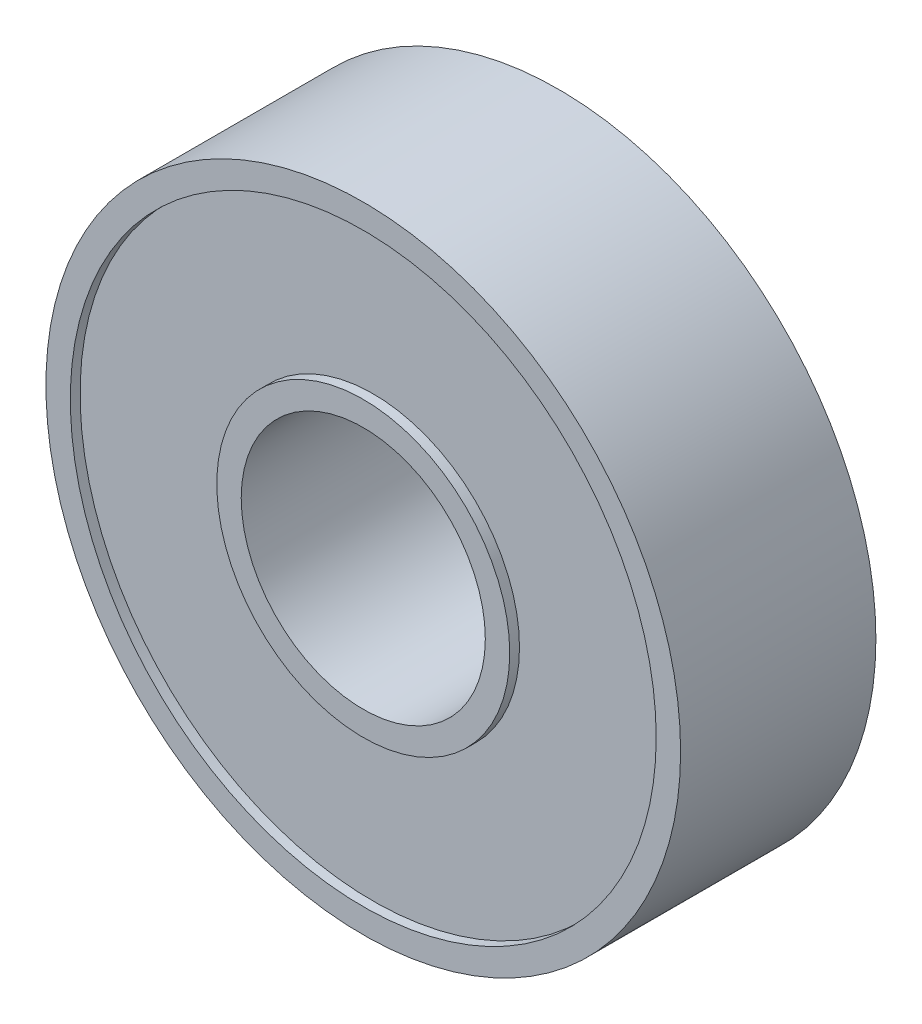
ISO-10303-21;
HEADER;
FILE_DESCRIPTION(('STEP AP214'),'2;1');
FILE_NAME('part.step','',(''),(''),'','','');
FILE_SCHEMA(('AUTOMOTIVE_DESIGN { 1 0 10303 214 1 1 1 1 }'));
ENDSEC;
DATA;
#1=APPLICATION_CONTEXT('core data for automotive mechanical design processes');
#2=APPLICATION_PROTOCOL_DEFINITION('international standard','automotive_design',2000,#1);
#3=PRODUCT_CONTEXT('',#1,'mechanical');
#4=PRODUCT('Part','Part','',(#3));
#5=PRODUCT_RELATED_PRODUCT_CATEGORY('part','',(#4));
#6=PRODUCT_DEFINITION_FORMATION('','',#4);
#7=PRODUCT_DEFINITION_CONTEXT('part definition',#1,'design');
#8=PRODUCT_DEFINITION('design','',#6,#7);
#9=PRODUCT_DEFINITION_SHAPE('','',#8);
#10=(LENGTH_UNIT() NAMED_UNIT(*) SI_UNIT(.MILLI.,.METRE.));
#11=(NAMED_UNIT(*) PLANE_ANGLE_UNIT() SI_UNIT($,.RADIAN.));
#12=(NAMED_UNIT(*) SI_UNIT($,.STERADIAN.) SOLID_ANGLE_UNIT());
#13=UNCERTAINTY_MEASURE_WITH_UNIT(LENGTH_MEASURE(1.E-05),#10,'distance_accuracy_value','');
#14=(GEOMETRIC_REPRESENTATION_CONTEXT(3) GLOBAL_UNCERTAINTY_ASSIGNED_CONTEXT((#13)) GLOBAL_UNIT_ASSIGNED_CONTEXT((#10,
#11,#12)) REPRESENTATION_CONTEXT('',''));
#15=CARTESIAN_POINT('',(0.,0.,0.));
#16=DIRECTION('',(0.,0.,1.));
#17=DIRECTION('',(1.,0.,0.));
#18=AXIS2_PLACEMENT_3D('',#15,#16,#17);
#19=CARTESIAN_POINT('',(0.,0.,0.));
#20=DIRECTION('',(0.,0.,1.));
#21=DIRECTION('',(1.,0.,0.));
#22=AXIS2_PLACEMENT_3D('',#19,#20,#21);
#23=PLANE('',#22);
#24=CARTESIAN_POINT('',(0.,0.,0.));
#25=DIRECTION('',(0.,0.,1.));
#26=DIRECTION('',(1.,0.,0.));
#27=AXIS2_PLACEMENT_3D('',#24,#25,#26);
#28=CIRCLE('',#27,2.5);
#29=CARTESIAN_POINT('',(2.5,0.,0.));
#30=VERTEX_POINT('',#29);
#31=EDGE_CURVE('E48',#30,#30,#28,.T.);
#32=ORIENTED_EDGE('',*,*,#31,.T.);
#33=EDGE_LOOP('',(#32));
#34=FACE_BOUND('',#33,.T.);
#35=CARTESIAN_POINT('',(0.,0.,0.));
#36=DIRECTION('',(0.,0.,-1.));
#37=DIRECTION('',(-1.,0.,0.));
#38=AXIS2_PLACEMENT_3D('',#35,#36,#37);
#39=CIRCLE('',#38,3.);
#40=CARTESIAN_POINT('',(-3.,0.,0.));
#41=VERTEX_POINT('',#40);
#42=EDGE_CURVE('E72',#41,#41,#39,.T.);
#43=ORIENTED_EDGE('',*,*,#42,.T.);
#44=EDGE_LOOP('',(#43));
#45=FACE_BOUND('',#44,.T.);
#46=ADVANCED_FACE('F35',(#34,#45),#23,.F.);
#47=CARTESIAN_POINT('',(0.,0.,4.));
#48=DIRECTION('',(0.,0.,1.));
#49=DIRECTION('',(1.,0.,0.));
#50=AXIS2_PLACEMENT_3D('',#47,#48,#49);
#51=PLANE('',#50);
#52=CARTESIAN_POINT('',(0.,0.,4.));
#53=DIRECTION('',(0.,0.,1.));
#54=DIRECTION('',(1.,0.,0.));
#55=AXIS2_PLACEMENT_3D('',#52,#53,#54);
#56=CIRCLE('',#55,2.5);
#57=CARTESIAN_POINT('',(2.5,0.,4.));
#58=VERTEX_POINT('',#57);
#59=EDGE_CURVE('E46',#58,#58,#56,.T.);
#60=ORIENTED_EDGE('',*,*,#59,.F.);
#61=EDGE_LOOP('',(#60));
#62=FACE_BOUND('',#61,.T.);
#63=CARTESIAN_POINT('',(0.,0.,4.));
#64=DIRECTION('',(0.,0.,1.));
#65=DIRECTION('',(1.,0.,0.));
#66=AXIS2_PLACEMENT_3D('',#63,#64,#65);
#67=CIRCLE('',#66,3.);
#68=CARTESIAN_POINT('',(3.,0.,4.));
#69=VERTEX_POINT('',#68);
#70=EDGE_CURVE('E60',#69,#69,#67,.T.);
#71=ORIENTED_EDGE('',*,*,#70,.T.);
#72=EDGE_LOOP('',(#71));
#73=FACE_BOUND('',#72,.T.);
#74=ADVANCED_FACE('F110',(#62,#73),#51,.T.);
#75=CARTESIAN_POINT('',(0.,0.,4.));
#76=DIRECTION('',(0.,0.,1.));
#77=DIRECTION('',(1.,0.,0.));
#78=AXIS2_PLACEMENT_3D('',#75,#76,#77);
#79=CIRCLE('',#78,6.);
#80=CARTESIAN_POINT('',(6.,0.,4.));
#81=VERTEX_POINT('',#80);
#82=EDGE_CURVE('E54',#81,#81,#79,.T.);
#83=ORIENTED_EDGE('',*,*,#82,.F.);
#84=EDGE_LOOP('',(#83));
#85=FACE_BOUND('',#84,.T.);
#86=CARTESIAN_POINT('',(0.,0.,4.));
#87=DIRECTION('',(0.,0.,1.));
#88=DIRECTION('',(1.,0.,0.));
#89=AXIS2_PLACEMENT_3D('',#86,#87,#88);
#90=CIRCLE('',#89,6.5);
#91=CARTESIAN_POINT('',(6.5,0.,4.));
#92=VERTEX_POINT('',#91);
#93=EDGE_CURVE('E10',#92,#92,#90,.T.);
#94=ORIENTED_EDGE('',*,*,#93,.T.);
#95=EDGE_LOOP('',(#94));
#96=FACE_BOUND('',#95,.T.);
#97=ADVANCED_FACE('F97',(#85,#96),#51,.T.);
#98=CARTESIAN_POINT('',(0.,0.,0.));
#99=DIRECTION('',(0.,0.,-1.));
#100=DIRECTION('',(-1.,0.,0.));
#101=AXIS2_PLACEMENT_3D('',#98,#99,#100);
#102=CIRCLE('',#101,6.);
#103=CARTESIAN_POINT('',(-6.,0.,0.));
#104=VERTEX_POINT('',#103);
#105=EDGE_CURVE('E66',#104,#104,#102,.T.);
#106=ORIENTED_EDGE('',*,*,#105,.F.);
#107=EDGE_LOOP('',(#106));
#108=FACE_BOUND('',#107,.T.);
#109=CARTESIAN_POINT('',(0.,0.,0.));
#110=DIRECTION('',(0.,0.,1.));
#111=DIRECTION('',(1.,0.,0.));
#112=AXIS2_PLACEMENT_3D('',#109,#110,#111);
#113=CIRCLE('',#112,6.5);
#114=CARTESIAN_POINT('',(6.5,0.,0.));
#115=VERTEX_POINT('',#114);
#116=EDGE_CURVE('E39',#115,#115,#113,.T.);
#117=ORIENTED_EDGE('',*,*,#116,.F.);
#118=EDGE_LOOP('',(#117));
#119=FACE_BOUND('',#118,.T.);
#120=ADVANCED_FACE('F94',(#108,#119),#23,.F.);
#121=CARTESIAN_POINT('',(0.,0.,4.));
#122=DIRECTION('',(0.,0.,-1.));
#123=DIRECTION('',(-1.,0.,0.));
#124=AXIS2_PLACEMENT_3D('',#121,#122,#123);
#125=CYLINDRICAL_SURFACE('',#124,6.5);
#126=ORIENTED_EDGE('',*,*,#93,.F.);
#127=EDGE_LOOP('',(#126));
#128=FACE_BOUND('',#127,.T.);
#129=ORIENTED_EDGE('',*,*,#116,.T.);
#130=EDGE_LOOP('',(#129));
#131=FACE_BOUND('',#130,.T.);
#132=ADVANCED_FACE('F37',(#128,#131),#125,.T.);
#133=CARTESIAN_POINT('',(0.,0.,4.));
#134=DIRECTION('',(0.,0.,-1.));
#135=DIRECTION('',(-1.,0.,0.));
#136=AXIS2_PLACEMENT_3D('',#133,#134,#135);
#137=CYLINDRICAL_SURFACE('',#136,2.5);
#138=ORIENTED_EDGE('',*,*,#59,.T.);
#139=EDGE_LOOP('',(#138));
#140=FACE_BOUND('',#139,.T.);
#141=ORIENTED_EDGE('',*,*,#31,.F.);
#142=EDGE_LOOP('',(#141));
#143=FACE_BOUND('',#142,.T.);
#144=ADVANCED_FACE('F101',(#140,#143),#137,.F.);
#145=CARTESIAN_POINT('',(0.,0.,3.8));
#146=DIRECTION('',(0.,0.,1.));
#147=DIRECTION('',(1.,0.,0.));
#148=AXIS2_PLACEMENT_3D('',#145,#146,#147);
#149=CYLINDRICAL_SURFACE('',#148,6.);
#150=CARTESIAN_POINT('',(0.,0.,3.8));
#151=DIRECTION('',(0.,0.,1.));
#152=DIRECTION('',(1.,0.,0.));
#153=AXIS2_PLACEMENT_3D('',#150,#151,#152);
#154=CIRCLE('',#153,6.);
#155=CARTESIAN_POINT('',(6.,0.,3.8));
#156=VERTEX_POINT('',#155);
#157=EDGE_CURVE('E51',#156,#156,#154,.T.);
#158=ORIENTED_EDGE('',*,*,#157,.F.);
#159=EDGE_LOOP('',(#158));
#160=FACE_BOUND('',#159,.T.);
#161=ORIENTED_EDGE('',*,*,#82,.T.);
#162=EDGE_LOOP('',(#161));
#163=FACE_BOUND('',#162,.T.);
#164=ADVANCED_FACE('F106',(#160,#163),#149,.F.);
#165=CARTESIAN_POINT('',(0.,0.,3.8));
#166=DIRECTION('',(0.,0.,1.));
#167=DIRECTION('',(1.,0.,0.));
#168=AXIS2_PLACEMENT_3D('',#165,#166,#167);
#169=PLANE('',#168);
#170=CARTESIAN_POINT('',(0.,0.,3.8));
#171=DIRECTION('',(0.,0.,1.));
#172=DIRECTION('',(1.,0.,0.));
#173=AXIS2_PLACEMENT_3D('',#170,#171,#172);
#174=CIRCLE('',#173,3.);
#175=CARTESIAN_POINT('',(3.,0.,3.8));
#176=VERTEX_POINT('',#175);
#177=EDGE_CURVE('E57',#176,#176,#174,.T.);
#178=ORIENTED_EDGE('',*,*,#177,.F.);
#179=EDGE_LOOP('',(#178));
#180=FACE_BOUND('',#179,.T.);
#181=ORIENTED_EDGE('',*,*,#157,.T.);
#182=EDGE_LOOP('',(#181));
#183=FACE_BOUND('',#182,.T.);
#184=ADVANCED_FACE('F123',(#180,#183),#169,.T.);
#185=CARTESIAN_POINT('',(0.,0.,3.8));
#186=DIRECTION('',(0.,0.,1.));
#187=DIRECTION('',(1.,0.,0.));
#188=AXIS2_PLACEMENT_3D('',#185,#186,#187);
#189=CYLINDRICAL_SURFACE('',#188,3.);
#190=ORIENTED_EDGE('',*,*,#177,.T.);
#191=EDGE_LOOP('',(#190));
#192=FACE_BOUND('',#191,.T.);
#193=ORIENTED_EDGE('',*,*,#70,.F.);
#194=EDGE_LOOP('',(#193));
#195=FACE_BOUND('',#194,.T.);
#196=ADVANCED_FACE('F90',(#192,#195),#189,.T.);
#197=CARTESIAN_POINT('',(0.,0.,0.2));
#198=DIRECTION('',(0.,0.,-1.));
#199=DIRECTION('',(-1.,0.,0.));
#200=AXIS2_PLACEMENT_3D('',#197,#198,#199);
#201=CYLINDRICAL_SURFACE('',#200,6.);
#202=CARTESIAN_POINT('',(0.,0.,0.2));
#203=DIRECTION('',(0.,0.,-1.));
#204=DIRECTION('',(-1.,0.,0.));
#205=AXIS2_PLACEMENT_3D('',#202,#203,#204);
#206=CIRCLE('',#205,6.);
#207=CARTESIAN_POINT('',(-6.,0.,0.2));
#208=VERTEX_POINT('',#207);
#209=EDGE_CURVE('E63',#208,#208,#206,.T.);
#210=ORIENTED_EDGE('',*,*,#209,.F.);
#211=EDGE_LOOP('',(#210));
#212=FACE_BOUND('',#211,.T.);
#213=ORIENTED_EDGE('',*,*,#105,.T.);
#214=EDGE_LOOP('',(#213));
#215=FACE_BOUND('',#214,.T.);
#216=ADVANCED_FACE('F84',(#212,#215),#201,.F.);
#217=CARTESIAN_POINT('',(0.,0.,0.2));
#218=DIRECTION('',(0.,0.,-1.));
#219=DIRECTION('',(-1.,0.,0.));
#220=AXIS2_PLACEMENT_3D('',#217,#218,#219);
#221=PLANE('',#220);
#222=CARTESIAN_POINT('',(0.,0.,0.2));
#223=DIRECTION('',(0.,0.,-1.));
#224=DIRECTION('',(-1.,0.,0.));
#225=AXIS2_PLACEMENT_3D('',#222,#223,#224);
#226=CIRCLE('',#225,3.);
#227=CARTESIAN_POINT('',(-3.,0.,0.2));
#228=VERTEX_POINT('',#227);
#229=EDGE_CURVE('E69',#228,#228,#226,.T.);
#230=ORIENTED_EDGE('',*,*,#229,.F.);
#231=EDGE_LOOP('',(#230));
#232=FACE_BOUND('',#231,.T.);
#233=ORIENTED_EDGE('',*,*,#209,.T.);
#234=EDGE_LOOP('',(#233));
#235=FACE_BOUND('',#234,.T.);
#236=ADVANCED_FACE('F81',(#232,#235),#221,.T.);
#237=CARTESIAN_POINT('',(0.,0.,0.2));
#238=DIRECTION('',(0.,0.,-1.));
#239=DIRECTION('',(-1.,0.,0.));
#240=AXIS2_PLACEMENT_3D('',#237,#238,#239);
#241=CYLINDRICAL_SURFACE('',#240,3.);
#242=ORIENTED_EDGE('',*,*,#229,.T.);
#243=EDGE_LOOP('',(#242));
#244=FACE_BOUND('',#243,.T.);
#245=ORIENTED_EDGE('',*,*,#42,.F.);
#246=EDGE_LOOP('',(#245));
#247=FACE_BOUND('',#246,.T.);
#248=ADVANCED_FACE('F78',(#244,#247),#241,.T.);
#249=CLOSED_SHELL('',(#46,#74,#97,#120,#132,#144,#164,#184,#196,#216,#236,#248));
#250=MANIFOLD_SOLID_BREP('B2',#249);
#251=ADVANCED_BREP_SHAPE_REPRESENTATION('',(#18,#250),#14);
#252=SHAPE_DEFINITION_REPRESENTATION(#9,#251);
ENDSEC;
END-ISO-10303-21;
